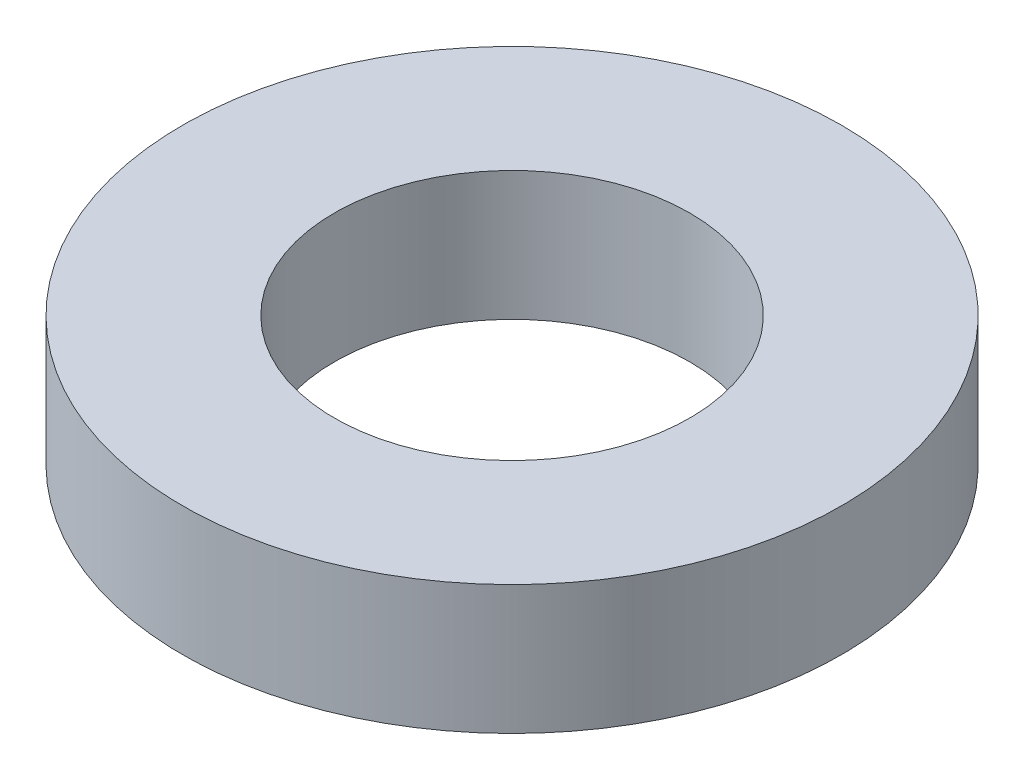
ISO-10303-21;
HEADER;
FILE_DESCRIPTION(('STEP AP214'),'2;1');
FILE_NAME('part.step','',(''),(''),'','','');
FILE_SCHEMA(('AUTOMOTIVE_DESIGN { 1 0 10303 214 1 1 1 1 }'));
ENDSEC;
DATA;
#1=APPLICATION_CONTEXT('core data for automotive mechanical design processes');
#2=APPLICATION_PROTOCOL_DEFINITION('international standard','automotive_design',2000,#1);
#3=PRODUCT_CONTEXT('',#1,'mechanical');
#4=PRODUCT('Part','Part','',(#3));
#5=PRODUCT_RELATED_PRODUCT_CATEGORY('part','',(#4));
#6=PRODUCT_DEFINITION_FORMATION('','',#4);
#7=PRODUCT_DEFINITION_CONTEXT('part definition',#1,'design');
#8=PRODUCT_DEFINITION('design','',#6,#7);
#9=PRODUCT_DEFINITION_SHAPE('','',#8);
#10=(LENGTH_UNIT() NAMED_UNIT(*) SI_UNIT(.MILLI.,.METRE.));
#11=(NAMED_UNIT(*) PLANE_ANGLE_UNIT() SI_UNIT($,.RADIAN.));
#12=(NAMED_UNIT(*) SI_UNIT($,.STERADIAN.) SOLID_ANGLE_UNIT());
#13=UNCERTAINTY_MEASURE_WITH_UNIT(LENGTH_MEASURE(1.E-05),#10,'distance_accuracy_value','');
#14=(GEOMETRIC_REPRESENTATION_CONTEXT(3) GLOBAL_UNCERTAINTY_ASSIGNED_CONTEXT((#13)) GLOBAL_UNIT_ASSIGNED_CONTEXT((#10,
#11,#12)) REPRESENTATION_CONTEXT('',''));
#15=CARTESIAN_POINT('',(0.,0.,0.));
#16=DIRECTION('',(0.,0.,1.));
#17=DIRECTION('',(1.,0.,0.));
#18=AXIS2_PLACEMENT_3D('',#15,#16,#17);
#19=CARTESIAN_POINT('',(2.921,0.5715,0.));
#20=DIRECTION('',(0.,1.,0.));
#21=DIRECTION('',(0.,0.,1.));
#22=AXIS2_PLACEMENT_3D('',#19,#20,#21);
#23=PLANE('',#22);
#24=CARTESIAN_POINT('',(0.,0.571499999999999,0.));
#25=DIRECTION('',(0.,-1.,0.));
#26=DIRECTION('',(0.,0.,-1.));
#27=AXIS2_PLACEMENT_3D('',#24,#25,#26);
#28=CIRCLE('',#27,1.5748);
#29=CARTESIAN_POINT('',(0.,0.571499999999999,-1.5748));
#30=VERTEX_POINT('',#29);
#31=EDGE_CURVE('E10',#30,#30,#28,.T.);
#32=ORIENTED_EDGE('',*,*,#31,.T.);
#33=EDGE_LOOP('',(#32));
#34=FACE_BOUND('',#33,.T.);
#35=CARTESIAN_POINT('',(0.,0.571499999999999,0.));
#36=DIRECTION('',(0.,-1.,0.));
#37=DIRECTION('',(0.,0.,-1.));
#38=AXIS2_PLACEMENT_3D('',#35,#36,#37);
#39=CIRCLE('',#38,2.921);
#40=CARTESIAN_POINT('',(0.,0.571499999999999,-2.921));
#41=VERTEX_POINT('',#40);
#42=EDGE_CURVE('E46',#41,#41,#39,.T.);
#43=ORIENTED_EDGE('',*,*,#42,.F.);
#44=EDGE_LOOP('',(#43));
#45=FACE_BOUND('',#44,.T.);
#46=ADVANCED_FACE('F32',(#34,#45),#23,.T.);
#47=CARTESIAN_POINT('',(0.,-11.4126253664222,0.));
#48=DIRECTION('',(0.,-1.,0.));
#49=DIRECTION('',(0.,0.,-1.));
#50=AXIS2_PLACEMENT_3D('',#47,#48,#49);
#51=CYLINDRICAL_SURFACE('',#50,1.5748);
#52=CARTESIAN_POINT('',(0.,-0.571499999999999,0.));
#53=DIRECTION('',(0.,-1.,0.));
#54=DIRECTION('',(0.,0.,-1.));
#55=AXIS2_PLACEMENT_3D('',#52,#53,#54);
#56=CIRCLE('',#55,1.5748);
#57=CARTESIAN_POINT('',(0.,-0.571499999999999,-1.5748));
#58=VERTEX_POINT('',#57);
#59=EDGE_CURVE('E38',#58,#58,#56,.T.);
#60=ORIENTED_EDGE('',*,*,#59,.T.);
#61=EDGE_LOOP('',(#60));
#62=FACE_BOUND('',#61,.T.);
#63=ORIENTED_EDGE('',*,*,#31,.F.);
#64=EDGE_LOOP('',(#63));
#65=FACE_BOUND('',#64,.T.);
#66=ADVANCED_FACE('F56',(#62,#65),#51,.F.);
#67=CARTESIAN_POINT('',(2.921,-0.5715,0.));
#68=DIRECTION('',(0.,-1.,0.));
#69=DIRECTION('',(0.,0.,-1.));
#70=AXIS2_PLACEMENT_3D('',#67,#68,#69);
#71=PLANE('',#70);
#72=CARTESIAN_POINT('',(0.,-0.571499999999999,0.));
#73=DIRECTION('',(0.,-1.,0.));
#74=DIRECTION('',(0.,0.,-1.));
#75=AXIS2_PLACEMENT_3D('',#72,#73,#74);
#76=CIRCLE('',#75,2.921);
#77=CARTESIAN_POINT('',(0.,-0.571499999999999,-2.921));
#78=VERTEX_POINT('',#77);
#79=EDGE_CURVE('E42',#78,#78,#76,.T.);
#80=ORIENTED_EDGE('',*,*,#79,.T.);
#81=EDGE_LOOP('',(#80));
#82=FACE_BOUND('',#81,.T.);
#83=ORIENTED_EDGE('',*,*,#59,.F.);
#84=EDGE_LOOP('',(#83));
#85=FACE_BOUND('',#84,.T.);
#86=ADVANCED_FACE('F60',(#82,#85),#71,.T.);
#87=CARTESIAN_POINT('',(0.,-11.4126253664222,0.));
#88=DIRECTION('',(0.,-1.,0.));
#89=DIRECTION('',(0.,0.,-1.));
#90=AXIS2_PLACEMENT_3D('',#87,#88,#89);
#91=CYLINDRICAL_SURFACE('',#90,2.921);
#92=ORIENTED_EDGE('',*,*,#42,.T.);
#93=EDGE_LOOP('',(#92));
#94=FACE_BOUND('',#93,.T.);
#95=ORIENTED_EDGE('',*,*,#79,.F.);
#96=EDGE_LOOP('',(#95));
#97=FACE_BOUND('',#96,.T.);
#98=ADVANCED_FACE('F52',(#94,#97),#91,.T.);
#99=CLOSED_SHELL('',(#46,#66,#86,#98));
#100=MANIFOLD_SOLID_BREP('B2',#99);
#101=ADVANCED_BREP_SHAPE_REPRESENTATION('',(#18,#100),#14);
#102=SHAPE_DEFINITION_REPRESENTATION(#9,#101);
ENDSEC;
END-ISO-10303-21;
